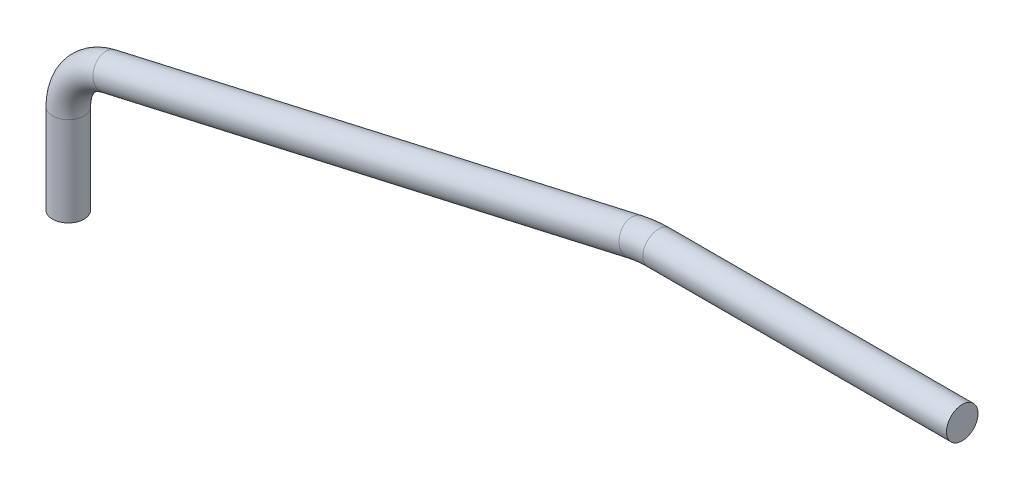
ISO-10303-21;
HEADER;
FILE_DESCRIPTION(('STEP AP214'),'2;1');
FILE_NAME('part.step','',(''),(''),'','','');
FILE_SCHEMA(('AUTOMOTIVE_DESIGN { 1 0 10303 214 1 1 1 1 }'));
ENDSEC;
DATA;
#1=APPLICATION_CONTEXT('core data for automotive mechanical design processes');
#2=APPLICATION_PROTOCOL_DEFINITION('international standard','automotive_design',2000,#1);
#3=PRODUCT_CONTEXT('',#1,'mechanical');
#4=PRODUCT('Part','Part','',(#3));
#5=PRODUCT_RELATED_PRODUCT_CATEGORY('part','',(#4));
#6=PRODUCT_DEFINITION_FORMATION('','',#4);
#7=PRODUCT_DEFINITION_CONTEXT('part definition',#1,'design');
#8=PRODUCT_DEFINITION('design','',#6,#7);
#9=PRODUCT_DEFINITION_SHAPE('','',#8);
#10=(LENGTH_UNIT() NAMED_UNIT(*) SI_UNIT(.MILLI.,.METRE.));
#11=(NAMED_UNIT(*) PLANE_ANGLE_UNIT() SI_UNIT($,.RADIAN.));
#12=(NAMED_UNIT(*) SI_UNIT($,.STERADIAN.) SOLID_ANGLE_UNIT());
#13=UNCERTAINTY_MEASURE_WITH_UNIT(LENGTH_MEASURE(1.E-05),#10,'distance_accuracy_value','');
#14=(GEOMETRIC_REPRESENTATION_CONTEXT(3) GLOBAL_UNCERTAINTY_ASSIGNED_CONTEXT((#13)) GLOBAL_UNIT_ASSIGNED_CONTEXT((#10,
#11,#12)) REPRESENTATION_CONTEXT('',''));
#15=CARTESIAN_POINT('',(0.,0.,0.));
#16=DIRECTION('',(0.,0.,1.));
#17=DIRECTION('',(1.,0.,0.));
#18=AXIS2_PLACEMENT_3D('',#15,#16,#17);
#19=CARTESIAN_POINT('',(-37.7558866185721,50.,0.));
#20=DIRECTION('',(1.,0.,0.));
#21=DIRECTION('',(0.,0.,-1.));
#22=AXIS2_PLACEMENT_3D('',#19,#20,#21);
#23=CYLINDRICAL_SURFACE('',#22,2.99999999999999);
#24=CARTESIAN_POINT('',(-37.7558866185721,50.,0.));
#25=DIRECTION('',(1.,0.,0.));
#26=DIRECTION('',(0.,0.,1.));
#27=AXIS2_PLACEMENT_3D('',#24,#25,#26);
#28=CIRCLE('',#27,2.99999999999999);
#29=CARTESIAN_POINT('',(-37.7558866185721,53.,0.));
#30=VERTEX_POINT('',#29);
#31=EDGE_CURVE('E30',#30,#30,#28,.T.);
#32=ORIENTED_EDGE('',*,*,#31,.T.);
#33=EDGE_LOOP('',(#32));
#34=FACE_BOUND('',#33,.T.);
#35=CARTESIAN_POINT('',(20.,50.,0.));
#36=DIRECTION('',(1.,0.,0.));
#37=DIRECTION('',(0.,0.,1.));
#38=AXIS2_PLACEMENT_3D('',#35,#36,#37);
#39=CIRCLE('',#38,2.99999999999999);
#40=CARTESIAN_POINT('',(20.,50.,2.99999999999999));
#41=VERTEX_POINT('',#40);
#42=EDGE_CURVE('E10',#41,#41,#39,.T.);
#43=ORIENTED_EDGE('',*,*,#42,.F.);
#44=EDGE_LOOP('',(#43));
#45=FACE_BOUND('',#44,.T.);
#46=ADVANCED_FACE('F24',(#34,#45),#23,.T.);
#47=CARTESIAN_POINT('',(-37.7558866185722,30.,0.));
#48=DIRECTION('',(0.,0.,-1.));
#49=DIRECTION('',(-1.,0.,0.));
#50=AXIS2_PLACEMENT_3D('',#47,#48,#49);
#51=TOROIDAL_SURFACE('',#50,20.,2.99999999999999);
#52=CARTESIAN_POINT('',(-42.1883086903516,49.5026571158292,0.));
#53=DIRECTION('',(0.975132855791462,0.221621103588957,0.));
#54=DIRECTION('',(0.,0.,1.));
#55=AXIS2_PLACEMENT_3D('',#52,#53,#54);
#56=CIRCLE('',#55,2.99999999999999);
#57=CARTESIAN_POINT('',(-42.8531720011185,52.4280556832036,0.));
#58=VERTEX_POINT('',#57);
#59=EDGE_CURVE('E34',#58,#58,#56,.T.);
#60=CARTESIAN_POINT('',(-37.7558866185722,30.,0.));
#61=DIRECTION('',(0.,0.,-1.));
#62=DIRECTION('',(-1.,0.,0.));
#63=AXIS2_PLACEMENT_3D('',#60,#61,#62);
#64=CIRCLE('',#63,23.);
#65=EDGE_CURVE('',#58,#30,#64,.T.);
#66=ORIENTED_EDGE('',*,*,#59,.T.);
#67=ORIENTED_EDGE('',*,*,#31,.F.);
#68=ORIENTED_EDGE('',*,*,#65,.T.);
#69=ORIENTED_EDGE('',*,*,#65,.F.);
#70=EDGE_LOOP('',(#66,#68,#67,#69));
#71=FACE_BOUND('',#70,.T.);
#72=ADVANCED_FACE('F61',(#71),#51,.T.);
#73=CARTESIAN_POINT('',(-142.21621103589,26.7690429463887,0.));
#74=DIRECTION('',(0.97513285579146,0.221621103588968,0.));
#75=DIRECTION('',(-0.221621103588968,0.97513285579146,0.));
#76=AXIS2_PLACEMENT_3D('',#73,#74,#75);
#77=CYLINDRICAL_SURFACE('',#76,2.99999999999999);
#78=CARTESIAN_POINT('',(-142.21621103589,26.7690429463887,0.));
#79=DIRECTION('',(0.975132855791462,0.221621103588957,0.));
#80=DIRECTION('',(0.,0.,1.));
#81=AXIS2_PLACEMENT_3D('',#78,#79,#80);
#82=CIRCLE('',#81,2.99999999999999);
#83=CARTESIAN_POINT('',(-142.881074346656,29.6944415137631,0.));
#84=VERTEX_POINT('',#83);
#85=EDGE_CURVE('E38',#84,#84,#82,.T.);
#86=CARTESIAN_POINT('',(-142.881074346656,29.6944415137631,0.));
#87=CARTESIAN_POINT('',(-141.839117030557,29.9312499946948,0.));
#88=CARTESIAN_POINT('',(-140.797159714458,30.1680584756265,0.));
#89=CARTESIAN_POINT('',(-138.713245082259,30.6416754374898,0.));
#90=CARTESIAN_POINT('',(-137.67128776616,30.8784839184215,0.));
#91=CARTESIAN_POINT('',(-135.587373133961,31.3521008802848,0.));
#92=CARTESIAN_POINT('',(-134.545415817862,31.5889093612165,0.));
#93=CARTESIAN_POINT('',(-132.461501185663,32.0625263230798,0.));
#94=CARTESIAN_POINT('',(-131.419543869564,32.2993348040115,0.));
#95=CARTESIAN_POINT('',(-129.335629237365,32.7729517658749,0.));
#96=CARTESIAN_POINT('',(-128.293671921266,33.0097602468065,0.));
#97=CARTESIAN_POINT('',(-126.209757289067,33.4833772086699,0.));
#98=CARTESIAN_POINT('',(-125.167799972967,33.7201856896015,0.));
#99=CARTESIAN_POINT('',(-123.083885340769,34.1938026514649,0.));
#100=CARTESIAN_POINT('',(-122.041928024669,34.4306111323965,0.));
#101=CARTESIAN_POINT('',(-119.958013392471,34.9042280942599,0.));
#102=CARTESIAN_POINT('',(-118.916056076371,35.1410365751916,0.));
#103=CARTESIAN_POINT('',(-116.832141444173,35.6146535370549,0.));
#104=CARTESIAN_POINT('',(-115.790184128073,35.8514620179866,0.));
#105=CARTESIAN_POINT('',(-113.706269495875,36.3250789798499,0.));
#106=CARTESIAN_POINT('',(-112.664312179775,36.5618874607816,0.));
#107=CARTESIAN_POINT('',(-110.580397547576,37.0355044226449,0.));
#108=CARTESIAN_POINT('',(-109.538440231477,37.2723129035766,0.));
#109=CARTESIAN_POINT('',(-107.454525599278,37.74592986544,0.));
#110=CARTESIAN_POINT('',(-106.412568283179,37.9827383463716,0.));
#111=CARTESIAN_POINT('',(-104.32865365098,38.456355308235,0.));
#112=CARTESIAN_POINT('',(-103.286696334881,38.6931637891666,0.));
#113=CARTESIAN_POINT('',(-101.202781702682,39.16678075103,0.));
#114=CARTESIAN_POINT('',(-100.160824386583,39.4035892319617,0.));
#115=CARTESIAN_POINT('',(-98.0769097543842,39.877206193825,0.));
#116=CARTESIAN_POINT('',(-97.0349524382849,40.1140146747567,0.));
#117=CARTESIAN_POINT('',(-94.9510378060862,40.58763163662,0.));
#118=CARTESIAN_POINT('',(-93.9090804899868,40.8244401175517,0.));
#119=CARTESIAN_POINT('',(-91.8251658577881,41.298057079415,0.));
#120=CARTESIAN_POINT('',(-90.7832085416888,41.5348655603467,0.));
#121=CARTESIAN_POINT('',(-88.6992939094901,42.00848252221,0.));
#122=CARTESIAN_POINT('',(-87.6573365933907,42.2452910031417,0.));
#123=CARTESIAN_POINT('',(-85.573421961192,42.7189079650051,0.));
#124=CARTESIAN_POINT('',(-84.5314646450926,42.9557164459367,0.));
#125=CARTESIAN_POINT('',(-82.4475500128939,43.4293334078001,0.));
#126=CARTESIAN_POINT('',(-81.4055926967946,43.6661418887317,0.));
#127=CARTESIAN_POINT('',(-79.3216780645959,44.1397588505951,0.));
#128=CARTESIAN_POINT('',(-78.2797207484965,44.3765673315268,0.));
#129=CARTESIAN_POINT('',(-76.1958061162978,44.8501842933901,0.));
#130=CARTESIAN_POINT('',(-75.1538488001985,45.0869927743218,0.));
#131=CARTESIAN_POINT('',(-73.0699341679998,45.5606097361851,0.));
#132=CARTESIAN_POINT('',(-72.0279768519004,45.7974182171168,0.));
#133=CARTESIAN_POINT('',(-69.9440622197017,46.2710351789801,0.));
#134=CARTESIAN_POINT('',(-68.9021049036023,46.5078436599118,0.));
#135=CARTESIAN_POINT('',(-66.8181902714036,46.9814606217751,0.));
#136=CARTESIAN_POINT('',(-65.7762329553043,47.2182691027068,0.));
#137=CARTESIAN_POINT('',(-63.6923183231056,47.6918860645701,0.));
#138=CARTESIAN_POINT('',(-62.6503610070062,47.9286945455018,0.));
#139=CARTESIAN_POINT('',(-60.5664463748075,48.4023115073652,0.));
#140=CARTESIAN_POINT('',(-59.5244890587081,48.6391199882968,0.));
#141=CARTESIAN_POINT('',(-57.4405744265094,49.1127369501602,0.));
#142=CARTESIAN_POINT('',(-56.3986171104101,49.3495454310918,0.));
#143=CARTESIAN_POINT('',(-54.3147024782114,49.8231623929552,0.));
#144=CARTESIAN_POINT('',(-53.272745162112,50.0599708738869,0.));
#145=CARTESIAN_POINT('',(-51.1888305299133,50.5335878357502,0.));
#146=CARTESIAN_POINT('',(-50.146873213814,50.7703963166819,0.));
#147=CARTESIAN_POINT('',(-48.0629585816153,51.2440132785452,0.));
#148=CARTESIAN_POINT('',(-47.0210012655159,51.4808217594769,0.));
#149=CARTESIAN_POINT('',(-44.9370866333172,51.9544387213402,0.));
#150=CARTESIAN_POINT('',(-43.8951293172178,52.1912472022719,0.));
#151=CARTESIAN_POINT('',(-42.8531720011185,52.4280556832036,0.));
#152=B_SPLINE_CURVE_WITH_KNOTS('',3,(#86,#87,#88,#89,#90,#91,#92,#93,#94,#95,#96,#97,#98,#99,
#100,#101,#102,#103,#104,#105,#106,#107,#108,#109,#110,#111,#112,#113,#114,#115,#116,#117,#118,
#119,#120,#121,#122,#123,#124,#125,#126,#127,#128,#129,#130,#131,#132,#133,#134,#135,#136,#137,
#138,#139,#140,#141,#142,#143,#144,#145,#146,#147,#148,#149,#150,#151),.UNSPECIFIED.,.F.,.F.,(4,
2,2,2,2,2,2,2,2,2,2,2,2,2,2,2,2,2,2,2,2,2,2,2,2,2,2,2,2,2,2,2,4),(0.,3.20558571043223,
6.41117142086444,9.61675713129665,12.8223428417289,16.0279285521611,19.2335142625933,
22.4390999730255,25.6446856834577,28.85027139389,32.0558571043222,35.2614428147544,
38.4670285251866,41.6726142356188,44.878199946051,48.0837856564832,51.2893713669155,
54.4949570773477,57.7005427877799,60.9061284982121,64.1117142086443,67.3172999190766,
70.5228856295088,73.728471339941,76.9340570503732,80.1396427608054,83.3452284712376,
86.5508141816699,89.7563998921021,92.9619856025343,96.1675713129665,99.3731570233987,
102.578742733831),.UNSPECIFIED.);
#153=EDGE_CURVE('BSEAM65',#84,#58,#152,.T.);
#154=ORIENTED_EDGE('',*,*,#85,.T.);
#155=ORIENTED_EDGE('',*,*,#59,.F.);
#156=ORIENTED_EDGE('',*,*,#153,.T.);
#157=ORIENTED_EDGE('',*,*,#153,.F.);
#158=EDGE_LOOP('',(#154,#156,#155,#157));
#159=FACE_BOUND('',#158,.T.);
#160=ADVANCED_FACE('F65',(#159),#77,.T.);
#161=CARTESIAN_POINT('',(-140.,17.0177143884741,0.));
#162=DIRECTION('',(0.,0.,-1.));
#163=DIRECTION('',(-1.,0.,0.));
#164=AXIS2_PLACEMENT_3D('',#161,#162,#163);
#165=TOROIDAL_SURFACE('',#164,10.,2.99999999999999);
#166=CARTESIAN_POINT('',(-150.,17.0177143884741,0.));
#167=DIRECTION('',(0.,1.,0.));
#168=DIRECTION('',(0.,0.,1.));
#169=AXIS2_PLACEMENT_3D('',#166,#167,#168);
#170=CIRCLE('',#169,2.99999999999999);
#171=CARTESIAN_POINT('',(-153.,17.017714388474,0.));
#172=VERTEX_POINT('',#171);
#173=EDGE_CURVE('E43',#172,#172,#170,.T.);
#174=CARTESIAN_POINT('',(-140.,17.0177143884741,0.));
#175=DIRECTION('',(0.,0.,-1.));
#176=DIRECTION('',(-1.,0.,0.));
#177=AXIS2_PLACEMENT_3D('',#174,#175,#176);
#178=CIRCLE('',#177,13.);
#179=EDGE_CURVE('',#172,#84,#178,.T.);
#180=ORIENTED_EDGE('',*,*,#173,.T.);
#181=ORIENTED_EDGE('',*,*,#85,.F.);
#182=ORIENTED_EDGE('',*,*,#179,.T.);
#183=ORIENTED_EDGE('',*,*,#179,.F.);
#184=EDGE_LOOP('',(#180,#182,#181,#183));
#185=FACE_BOUND('',#184,.T.);
#186=ADVANCED_FACE('F71',(#185),#165,.T.);
#187=CARTESIAN_POINT('',(-150.,17.0177143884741,0.));
#188=DIRECTION('',(0.,-1.,0.));
#189=DIRECTION('',(0.,0.,-1.));
#190=AXIS2_PLACEMENT_3D('',#187,#188,#189);
#191=CYLINDRICAL_SURFACE('',#190,2.99999999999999);
#192=ORIENTED_EDGE('',*,*,#173,.F.);
#193=EDGE_LOOP('',(#192));
#194=FACE_BOUND('',#193,.T.);
#195=CARTESIAN_POINT('',(-150.,0.,0.));
#196=DIRECTION('',(0.,1.,0.));
#197=DIRECTION('',(0.,0.,1.));
#198=AXIS2_PLACEMENT_3D('',#195,#196,#197);
#199=CIRCLE('',#198,2.99999999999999);
#200=CARTESIAN_POINT('',(-150.,0.,2.99999999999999));
#201=VERTEX_POINT('',#200);
#202=EDGE_CURVE('E46',#201,#201,#199,.T.);
#203=ORIENTED_EDGE('',*,*,#202,.T.);
#204=EDGE_LOOP('',(#203));
#205=FACE_BOUND('',#204,.T.);
#206=ADVANCED_FACE('F50',(#194,#205),#191,.T.);
#207=CARTESIAN_POINT('',(20.,50.,0.));
#208=DIRECTION('',(1.,0.,0.));
#209=DIRECTION('',(0.,0.,1.));
#210=AXIS2_PLACEMENT_3D('',#207,#208,#209);
#211=PLANE('',#210);
#212=ORIENTED_EDGE('',*,*,#42,.T.);
#213=EDGE_LOOP('',(#212));
#214=FACE_BOUND('',#213,.T.);
#215=ADVANCED_FACE('F54',(#214),#211,.T.);
#216=CARTESIAN_POINT('',(-150.,0.,0.));
#217=DIRECTION('',(0.,1.,0.));
#218=DIRECTION('',(0.,0.,1.));
#219=AXIS2_PLACEMENT_3D('',#216,#217,#218);
#220=PLANE('',#219);
#221=ORIENTED_EDGE('',*,*,#202,.F.);
#222=EDGE_LOOP('',(#221));
#223=FACE_BOUND('',#222,.T.);
#224=ADVANCED_FACE('F52',(#223),#220,.F.);
#225=CLOSED_SHELL('',(#46,#72,#160,#186,#206,#215,#224));
#226=MANIFOLD_SOLID_BREP('B2',#225);
#227=ADVANCED_BREP_SHAPE_REPRESENTATION('',(#18,#226),#14);
#228=SHAPE_DEFINITION_REPRESENTATION(#9,#227);
ENDSEC;
END-ISO-10303-21;
